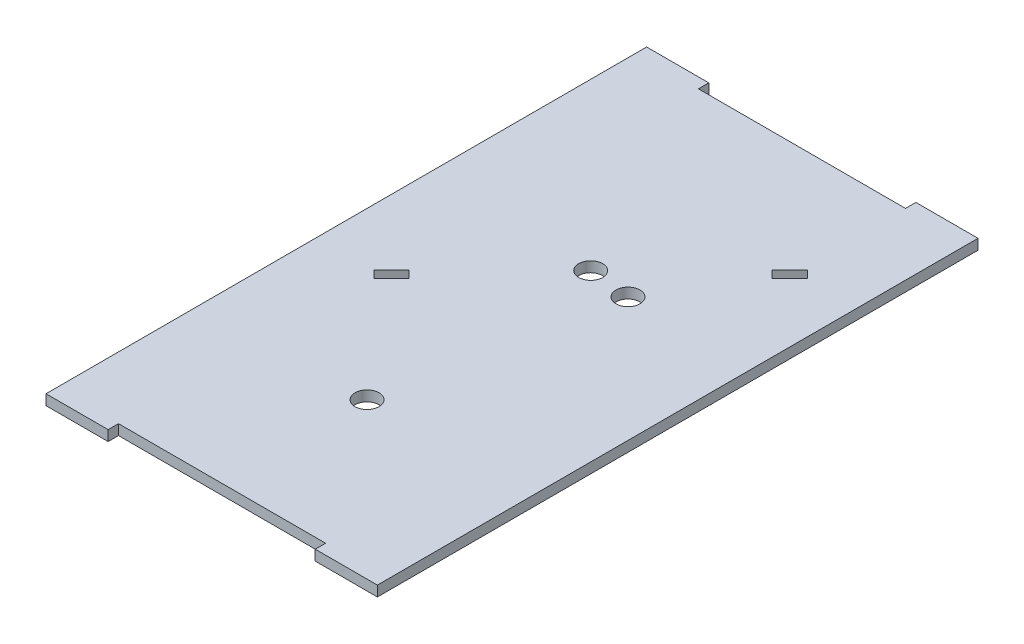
ISO-10303-21;
HEADER;
FILE_DESCRIPTION(('STEP AP214'),'2;1');
FILE_NAME('part.step','',(''),(''),'','','');
FILE_SCHEMA(('AUTOMOTIVE_DESIGN { 1 0 10303 214 1 1 1 1 }'));
ENDSEC;
DATA;
#1=APPLICATION_CONTEXT('core data for automotive mechanical design processes');
#2=APPLICATION_PROTOCOL_DEFINITION('international standard','automotive_design',2000,#1);
#3=PRODUCT_CONTEXT('',#1,'mechanical');
#4=PRODUCT('Part','Part','',(#3));
#5=PRODUCT_RELATED_PRODUCT_CATEGORY('part','',(#4));
#6=PRODUCT_DEFINITION_FORMATION('','',#4);
#7=PRODUCT_DEFINITION_CONTEXT('part definition',#1,'design');
#8=PRODUCT_DEFINITION('design','',#6,#7);
#9=PRODUCT_DEFINITION_SHAPE('','',#8);
#10=(LENGTH_UNIT() NAMED_UNIT(*) SI_UNIT(.MILLI.,.METRE.));
#11=(NAMED_UNIT(*) PLANE_ANGLE_UNIT() SI_UNIT($,.RADIAN.));
#12=(NAMED_UNIT(*) SI_UNIT($,.STERADIAN.) SOLID_ANGLE_UNIT());
#13=UNCERTAINTY_MEASURE_WITH_UNIT(LENGTH_MEASURE(1.E-05),#10,'distance_accuracy_value','');
#14=(GEOMETRIC_REPRESENTATION_CONTEXT(3) GLOBAL_UNCERTAINTY_ASSIGNED_CONTEXT((#13)) GLOBAL_UNIT_ASSIGNED_CONTEXT((#10,
#11,#12)) REPRESENTATION_CONTEXT('',''));
#15=CARTESIAN_POINT('',(0.,0.,0.));
#16=DIRECTION('',(0.,0.,1.));
#17=DIRECTION('',(1.,0.,0.));
#18=AXIS2_PLACEMENT_3D('',#15,#16,#17);
#19=CARTESIAN_POINT('',(0.,3.175,0.));
#20=DIRECTION('',(0.,0.,-1.));
#21=DIRECTION('',(-1.,0.,0.));
#22=AXIS2_PLACEMENT_3D('',#19,#20,#21);
#23=PLANE('',#22);
#24=DIRECTION('',(0.,-1.,0.));
#25=VECTOR('',#24,1.);
#26=CARTESIAN_POINT('',(19.05,3.175,0.));
#27=LINE('',#26,#25);
#28=CARTESIAN_POINT('',(19.05,3.175,0.));
#29=VERTEX_POINT('',#28);
#30=CARTESIAN_POINT('',(19.05,0.,0.));
#31=VERTEX_POINT('',#30);
#32=EDGE_CURVE('E236',#29,#31,#27,.T.);
#33=ORIENTED_EDGE('',*,*,#32,.T.);
#34=DIRECTION('',(1.,0.,0.));
#35=VECTOR('',#34,1.);
#36=CARTESIAN_POINT('',(0.,0.,0.));
#37=LINE('',#36,#35);
#38=CARTESIAN_POINT('',(82.55,0.,0.));
#39=VERTEX_POINT('',#38);
#40=EDGE_CURVE('E278',#31,#39,#37,.T.);
#41=ORIENTED_EDGE('',*,*,#40,.T.);
#42=DIRECTION('',(0.,-1.,0.));
#43=VECTOR('',#42,1.);
#44=CARTESIAN_POINT('',(82.55,3.175,0.));
#45=LINE('',#44,#43);
#46=CARTESIAN_POINT('',(82.55,3.175,0.));
#47=VERTEX_POINT('',#46);
#48=EDGE_CURVE('E263',#47,#39,#45,.T.);
#49=ORIENTED_EDGE('',*,*,#48,.F.);
#50=DIRECTION('',(1.,0.,0.));
#51=VECTOR('',#50,1.);
#52=CARTESIAN_POINT('',(0.,3.175,0.));
#53=LINE('',#52,#51);
#54=EDGE_CURVE('E283',#29,#47,#53,.T.);
#55=ORIENTED_EDGE('',*,*,#54,.F.);
#56=EDGE_LOOP('',(#33,#41,#49,#55));
#57=FACE_BOUND('',#56,.T.);
#58=ADVANCED_FACE('F33',(#57),#23,.F.);
#59=CARTESIAN_POINT('',(101.6,3.175,-177.8));
#60=DIRECTION('',(0.,0.,1.));
#61=DIRECTION('',(1.,0.,0.));
#62=AXIS2_PLACEMENT_3D('',#59,#60,#61);
#63=PLANE('',#62);
#64=DIRECTION('',(0.,-1.,0.));
#65=VECTOR('',#64,1.);
#66=CARTESIAN_POINT('',(82.55,3.175,-177.8));
#67=LINE('',#66,#65);
#68=CARTESIAN_POINT('',(82.55,3.175,-177.8));
#69=VERTEX_POINT('',#68);
#70=CARTESIAN_POINT('',(82.55,0.,-177.8));
#71=VERTEX_POINT('',#70);
#72=EDGE_CURVE('E332',#69,#71,#67,.T.);
#73=ORIENTED_EDGE('',*,*,#72,.T.);
#74=DIRECTION('',(-1.,0.,0.));
#75=VECTOR('',#74,1.);
#76=CARTESIAN_POINT('',(101.6,0.,-177.8));
#77=LINE('',#76,#75);
#78=CARTESIAN_POINT('',(19.05,0.,-177.8));
#79=VERTEX_POINT('',#78);
#80=EDGE_CURVE('E291',#71,#79,#77,.T.);
#81=ORIENTED_EDGE('',*,*,#80,.T.);
#82=DIRECTION('',(0.,-1.,0.));
#83=VECTOR('',#82,1.);
#84=CARTESIAN_POINT('',(19.05,3.175,-177.8));
#85=LINE('',#84,#83);
#86=CARTESIAN_POINT('',(19.05,3.175,-177.8));
#87=VERTEX_POINT('',#86);
#88=EDGE_CURVE('E294',#87,#79,#85,.T.);
#89=ORIENTED_EDGE('',*,*,#88,.F.);
#90=DIRECTION('',(-1.,0.,0.));
#91=VECTOR('',#90,1.);
#92=CARTESIAN_POINT('',(101.6,3.175,-177.8));
#93=LINE('',#92,#91);
#94=EDGE_CURVE('E303',#69,#87,#93,.T.);
#95=ORIENTED_EDGE('',*,*,#94,.F.);
#96=EDGE_LOOP('',(#73,#81,#89,#95));
#97=FACE_BOUND('',#96,.T.);
#98=ADVANCED_FACE('F353',(#97),#63,.F.);
#99=CARTESIAN_POINT('',(0.,3.175,0.));
#100=DIRECTION('',(1.,0.,0.));
#101=DIRECTION('',(0.,0.,-1.));
#102=AXIS2_PLACEMENT_3D('',#99,#100,#101);
#103=PLANE('',#102);
#104=DIRECTION('',(0.,0.,1.));
#105=VECTOR('',#104,1.);
#106=CARTESIAN_POINT('',(0.,0.,0.));
#107=LINE('',#106,#105);
#108=CARTESIAN_POINT('',(0.,0.,-180.975));
#109=VERTEX_POINT('',#108);
#110=CARTESIAN_POINT('',(0.,0.,3.17500000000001));
#111=VERTEX_POINT('',#110);
#112=EDGE_CURVE('E282',#109,#111,#107,.T.);
#113=ORIENTED_EDGE('',*,*,#112,.T.);
#114=DIRECTION('',(0.,-1.,0.));
#115=VECTOR('',#114,1.);
#116=CARTESIAN_POINT('',(0.,3.175,3.17500000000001));
#117=LINE('',#116,#115);
#118=CARTESIAN_POINT('',(0.,3.175,3.17500000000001));
#119=VERTEX_POINT('',#118);
#120=EDGE_CURVE('E246',#119,#111,#117,.T.);
#121=ORIENTED_EDGE('',*,*,#120,.F.);
#122=DIRECTION('',(0.,0.,1.));
#123=VECTOR('',#122,1.);
#124=CARTESIAN_POINT('',(0.,3.175,0.));
#125=LINE('',#124,#123);
#126=CARTESIAN_POINT('',(0.,3.175,-180.975));
#127=VERTEX_POINT('',#126);
#128=EDGE_CURVE('E300',#127,#119,#125,.T.);
#129=ORIENTED_EDGE('',*,*,#128,.F.);
#130=DIRECTION('',(0.,-1.,0.));
#131=VECTOR('',#130,1.);
#132=CARTESIAN_POINT('',(0.,3.175,-180.975));
#133=LINE('',#132,#131);
#134=EDGE_CURVE('E315',#127,#109,#133,.T.);
#135=ORIENTED_EDGE('',*,*,#134,.T.);
#136=EDGE_LOOP('',(#113,#121,#129,#135));
#137=FACE_BOUND('',#136,.T.);
#138=ADVANCED_FACE('F35',(#137),#103,.F.);
#139=CARTESIAN_POINT('',(101.6,3.175,0.));
#140=DIRECTION('',(-1.,0.,0.));
#141=DIRECTION('',(0.,0.,1.));
#142=AXIS2_PLACEMENT_3D('',#139,#140,#141);
#143=PLANE('',#142);
#144=DIRECTION('',(0.,0.,-1.));
#145=VECTOR('',#144,1.);
#146=CARTESIAN_POINT('',(101.6,0.,0.));
#147=LINE('',#146,#145);
#148=CARTESIAN_POINT('',(101.6,0.,3.17500000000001));
#149=VERTEX_POINT('',#148);
#150=CARTESIAN_POINT('',(101.6,0.,-180.975));
#151=VERTEX_POINT('',#150);
#152=EDGE_CURVE('E281',#149,#151,#147,.T.);
#153=ORIENTED_EDGE('',*,*,#152,.T.);
#154=DIRECTION('',(0.,-1.,0.));
#155=VECTOR('',#154,1.);
#156=CARTESIAN_POINT('',(101.6,3.175,-180.975));
#157=LINE('',#156,#155);
#158=CARTESIAN_POINT('',(101.6,3.175,-180.975));
#159=VERTEX_POINT('',#158);
#160=EDGE_CURVE('E326',#159,#151,#157,.T.);
#161=ORIENTED_EDGE('',*,*,#160,.F.);
#162=DIRECTION('',(0.,0.,-1.));
#163=VECTOR('',#162,1.);
#164=CARTESIAN_POINT('',(101.6,3.175,0.));
#165=LINE('',#164,#163);
#166=CARTESIAN_POINT('',(101.6,3.175,3.17500000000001));
#167=VERTEX_POINT('',#166);
#168=EDGE_CURVE('E305',#167,#159,#165,.T.);
#169=ORIENTED_EDGE('',*,*,#168,.F.);
#170=DIRECTION('',(0.,-1.,0.));
#171=VECTOR('',#170,1.);
#172=CARTESIAN_POINT('',(101.6,3.175,3.17500000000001));
#173=LINE('',#172,#171);
#174=EDGE_CURVE('E253',#167,#149,#173,.T.);
#175=ORIENTED_EDGE('',*,*,#174,.T.);
#176=EDGE_LOOP('',(#153,#161,#169,#175));
#177=FACE_BOUND('',#176,.T.);
#178=ADVANCED_FACE('F391',(#177),#143,.F.);
#179=CARTESIAN_POINT('',(0.,3.175,0.));
#180=DIRECTION('',(0.,1.,0.));
#181=DIRECTION('',(0.,0.,1.));
#182=AXIS2_PLACEMENT_3D('',#179,#180,#181);
#183=PLANE('',#182);
#184=DIRECTION('',(-0.707106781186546,0.,0.707106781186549));
#185=VECTOR('',#184,1.);
#186=CARTESIAN_POINT('',(83.8466014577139,3.175,-146.404268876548));
#187=LINE('',#186,#185);
#188=CARTESIAN_POINT('',(83.8466014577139,3.175,-146.404268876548));
#189=VERTEX_POINT('',#188);
#190=CARTESIAN_POINT('',(78.4584477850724,3.175,-141.016115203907));
#191=VERTEX_POINT('',#190);
#192=EDGE_CURVE('E48',#189,#191,#187,.T.);
#193=ORIENTED_EDGE('',*,*,#192,.F.);
#194=DIRECTION('',(-0.707106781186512,0.,-0.707106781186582));
#195=VECTOR('',#194,1.);
#196=CARTESIAN_POINT('',(83.8466014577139,3.175,-146.404268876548));
#197=LINE('',#196,#195);
#198=CARTESIAN_POINT('',(86.0916654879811,3.175,-144.159204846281));
#199=VERTEX_POINT('',#198);
#200=EDGE_CURVE('E189',#199,#189,#197,.T.);
#201=ORIENTED_EDGE('',*,*,#200,.F.);
#202=DIRECTION('',(0.707106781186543,0.,-0.707106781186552));
#203=VECTOR('',#202,1.);
#204=CARTESIAN_POINT('',(86.0916654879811,3.175,-144.159204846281));
#205=LINE('',#204,#203);
#206=CARTESIAN_POINT('',(80.7035118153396,3.175,-138.771051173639));
#207=VERTEX_POINT('',#206);
#208=EDGE_CURVE('E173',#207,#199,#205,.T.);
#209=ORIENTED_EDGE('',*,*,#208,.F.);
#210=DIRECTION('',(0.707106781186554,0.,0.707106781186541));
#211=VECTOR('',#210,1.);
#212=CARTESIAN_POINT('',(78.4584477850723,3.175,-141.016115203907));
#213=LINE('',#212,#211);
#214=EDGE_CURVE('E182',#191,#207,#213,.T.);
#215=ORIENTED_EDGE('',*,*,#214,.F.);
#216=EDGE_LOOP('',(#193,#201,#209,#215));
#217=FACE_BOUND('',#216,.T.);
#218=DIRECTION('',(0.707106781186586,0.,0.707106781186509));
#219=VECTOR('',#218,1.);
#220=CARTESIAN_POINT('',(17.4257311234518,3.175,-79.9833985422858));
#221=LINE('',#220,#219);
#222=CARTESIAN_POINT('',(17.4257311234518,3.175,-79.9833985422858));
#223=VERTEX_POINT('',#222);
#224=CARTESIAN_POINT('',(19.6707951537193,3.175,-77.7383345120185));
#225=VERTEX_POINT('',#224);
#226=EDGE_CURVE('E196',#223,#225,#221,.T.);
#227=ORIENTED_EDGE('',*,*,#226,.F.);
#228=DIRECTION('',(-0.707106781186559,0.,0.707106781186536));
#229=VECTOR('',#228,1.);
#230=CARTESIAN_POINT('',(17.4257311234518,3.175,-79.9833985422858));
#231=LINE('',#230,#229);
#232=CARTESIAN_POINT('',(22.8138847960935,3.175,-85.3715522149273));
#233=VERTEX_POINT('',#232);
#234=EDGE_CURVE('E206',#233,#223,#231,.T.);
#235=ORIENTED_EDGE('',*,*,#234,.F.);
#236=DIRECTION('',(-0.707106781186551,0.,-0.707106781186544));
#237=VECTOR('',#236,1.);
#238=CARTESIAN_POINT('',(22.8138847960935,3.175,-85.3715522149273));
#239=LINE('',#238,#237);
#240=CARTESIAN_POINT('',(25.0589488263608,3.175,-83.12648818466));
#241=VERTEX_POINT('',#240);
#242=EDGE_CURVE('E203',#241,#233,#239,.T.);
#243=ORIENTED_EDGE('',*,*,#242,.F.);
#244=DIRECTION('',(0.707106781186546,0.,-0.707106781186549));
#245=VECTOR('',#244,1.);
#246=CARTESIAN_POINT('',(19.6707951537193,3.175,-77.7383345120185));
#247=LINE('',#246,#245);
#248=EDGE_CURVE('E200',#225,#241,#247,.T.);
#249=ORIENTED_EDGE('',*,*,#248,.F.);
#250=EDGE_LOOP('',(#227,#235,#243,#249));
#251=FACE_BOUND('',#250,.T.);
#252=CARTESIAN_POINT('',(50.8,3.175,-113.03));
#253=DIRECTION('',(0.,1.,0.));
#254=DIRECTION('',(0.,0.,1.));
#255=AXIS2_PLACEMENT_3D('',#252,#253,#254);
#256=CIRCLE('',#255,3.683);
#257=CARTESIAN_POINT('',(50.8,3.175,-109.347));
#258=VERTEX_POINT('',#257);
#259=EDGE_CURVE('E212',#258,#258,#256,.T.);
#260=ORIENTED_EDGE('',*,*,#259,.F.);
#261=EDGE_LOOP('',(#260));
#262=FACE_BOUND('',#261,.T.);
#263=CARTESIAN_POINT('',(50.8,3.175,-44.45));
#264=DIRECTION('',(0.,1.,0.));
#265=DIRECTION('',(0.,0.,1.));
#266=AXIS2_PLACEMENT_3D('',#263,#264,#265);
#267=CIRCLE('',#266,3.683);
#268=CARTESIAN_POINT('',(50.8,3.175,-40.767));
#269=VERTEX_POINT('',#268);
#270=EDGE_CURVE('E222',#269,#269,#267,.T.);
#271=ORIENTED_EDGE('',*,*,#270,.F.);
#272=EDGE_LOOP('',(#271));
#273=FACE_BOUND('',#272,.T.);
#274=CARTESIAN_POINT('',(63.5,3.175,-111.76));
#275=DIRECTION('',(0.,1.,0.));
#276=DIRECTION('',(0.,0.,1.));
#277=AXIS2_PLACEMENT_3D('',#274,#275,#276);
#278=CIRCLE('',#277,3.68299999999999);
#279=CARTESIAN_POINT('',(63.5,3.175,-108.077));
#280=VERTEX_POINT('',#279);
#281=EDGE_CURVE('E226',#280,#280,#278,.T.);
#282=ORIENTED_EDGE('',*,*,#281,.F.);
#283=EDGE_LOOP('',(#282));
#284=FACE_BOUND('',#283,.T.);
#285=ORIENTED_EDGE('',*,*,#128,.T.);
#286=DIRECTION('',(1.,0.,0.));
#287=VECTOR('',#286,1.);
#288=CARTESIAN_POINT('',(0.,3.175,3.17500000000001));
#289=LINE('',#288,#287);
#290=CARTESIAN_POINT('',(19.05,3.175,3.17500000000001));
#291=VERTEX_POINT('',#290);
#292=EDGE_CURVE('E230',#119,#291,#289,.T.);
#293=ORIENTED_EDGE('',*,*,#292,.T.);
#294=DIRECTION('',(0.,0.,-1.));
#295=VECTOR('',#294,1.);
#296=CARTESIAN_POINT('',(19.05,3.175,0.));
#297=LINE('',#296,#295);
#298=EDGE_CURVE('E232',#291,#29,#297,.T.);
#299=ORIENTED_EDGE('',*,*,#298,.T.);
#300=ORIENTED_EDGE('',*,*,#54,.T.);
#301=DIRECTION('',(0.,0.,1.));
#302=VECTOR('',#301,1.);
#303=CARTESIAN_POINT('',(82.55,3.175,0.));
#304=LINE('',#303,#302);
#305=CARTESIAN_POINT('',(82.55,3.175,3.17500000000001));
#306=VERTEX_POINT('',#305);
#307=EDGE_CURVE('E254',#47,#306,#304,.T.);
#308=ORIENTED_EDGE('',*,*,#307,.T.);
#309=DIRECTION('',(1.,0.,0.));
#310=VECTOR('',#309,1.);
#311=CARTESIAN_POINT('',(101.6,3.175,3.17500000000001));
#312=LINE('',#311,#310);
#313=EDGE_CURVE('E250',#306,#167,#312,.T.);
#314=ORIENTED_EDGE('',*,*,#313,.T.);
#315=ORIENTED_EDGE('',*,*,#168,.T.);
#316=DIRECTION('',(-1.,0.,0.));
#317=VECTOR('',#316,1.);
#318=CARTESIAN_POINT('',(101.6,3.175,-180.975));
#319=LINE('',#318,#317);
#320=CARTESIAN_POINT('',(82.55,3.175,-180.975));
#321=VERTEX_POINT('',#320);
#322=EDGE_CURVE('E266',#159,#321,#319,.T.);
#323=ORIENTED_EDGE('',*,*,#322,.T.);
#324=DIRECTION('',(0.,0.,1.));
#325=VECTOR('',#324,1.);
#326=CARTESIAN_POINT('',(82.55,3.175,-177.8));
#327=LINE('',#326,#325);
#328=EDGE_CURVE('E335',#321,#69,#327,.T.);
#329=ORIENTED_EDGE('',*,*,#328,.T.);
#330=ORIENTED_EDGE('',*,*,#94,.T.);
#331=DIRECTION('',(0.,0.,-1.));
#332=VECTOR('',#331,1.);
#333=CARTESIAN_POINT('',(19.05,3.175,-177.8));
#334=LINE('',#333,#332);
#335=CARTESIAN_POINT('',(19.05,3.175,-180.975));
#336=VERTEX_POINT('',#335);
#337=EDGE_CURVE('E322',#87,#336,#334,.T.);
#338=ORIENTED_EDGE('',*,*,#337,.T.);
#339=DIRECTION('',(-1.,0.,0.));
#340=VECTOR('',#339,1.);
#341=CARTESIAN_POINT('',(0.,3.175,-180.975));
#342=LINE('',#341,#340);
#343=EDGE_CURVE('E318',#336,#127,#342,.T.);
#344=ORIENTED_EDGE('',*,*,#343,.T.);
#345=EDGE_LOOP('',(#285,#293,#299,#300,#308,#314,#315,#323,#329,#330,#338,#344));
#346=FACE_BOUND('',#345,.T.);
#347=ADVANCED_FACE('F186',(#217,#251,#262,#273,#284,#346),#183,.T.);
#348=CARTESIAN_POINT('',(0.,0.,0.));
#349=DIRECTION('',(0.,1.,0.));
#350=DIRECTION('',(0.,0.,1.));
#351=AXIS2_PLACEMENT_3D('',#348,#349,#350);
#352=PLANE('',#351);
#353=DIRECTION('',(-0.707106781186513,0.,-0.707106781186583));
#354=VECTOR('',#353,1.);
#355=CARTESIAN_POINT('',(115.125435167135,0.,-115.125435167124));
#356=LINE('',#355,#354);
#357=CARTESIAN_POINT('',(86.0916654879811,0.,-144.159204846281));
#358=VERTEX_POINT('',#357);
#359=CARTESIAN_POINT('',(83.8466014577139,0.,-146.404268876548));
#360=VERTEX_POINT('',#359);
#361=EDGE_CURVE('E41',#358,#360,#356,.T.);
#362=ORIENTED_EDGE('',*,*,#361,.T.);
#363=DIRECTION('',(-0.707106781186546,0.,0.707106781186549));
#364=VECTOR('',#363,1.);
#365=CARTESIAN_POINT('',(-31.278833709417,0.,-31.2788337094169));
#366=LINE('',#365,#364);
#367=CARTESIAN_POINT('',(78.4584477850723,0.,-141.016115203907));
#368=VERTEX_POINT('',#367);
#369=EDGE_CURVE('E11',#360,#368,#366,.T.);
#370=ORIENTED_EDGE('',*,*,#369,.T.);
#371=DIRECTION('',(0.707106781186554,0.,0.707106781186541));
#372=VECTOR('',#371,1.);
#373=CARTESIAN_POINT('',(109.737281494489,0.,-109.737281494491));
#374=LINE('',#373,#372);
#375=CARTESIAN_POINT('',(80.7035118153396,0.,-138.77105117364));
#376=VERTEX_POINT('',#375);
#377=EDGE_CURVE('E650',#368,#376,#374,.T.);
#378=ORIENTED_EDGE('',*,*,#377,.T.);
#379=DIRECTION('',(0.707106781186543,0.,-0.707106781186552));
#380=VECTOR('',#379,1.);
#381=CARTESIAN_POINT('',(-29.0337696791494,0.,-29.033769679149));
#382=LINE('',#381,#380);
#383=EDGE_CURVE('E176',#376,#358,#382,.T.);
#384=ORIENTED_EDGE('',*,*,#383,.T.);
#385=EDGE_LOOP('',(#362,#370,#378,#384));
#386=FACE_BOUND('',#385,.T.);
#387=DIRECTION('',(-0.707106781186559,0.,0.707106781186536));
#388=VECTOR('',#387,1.);
#389=CARTESIAN_POINT('',(-31.2788337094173,0.,-31.2788337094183));
#390=LINE('',#389,#388);
#391=CARTESIAN_POINT('',(22.8138847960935,0.,-85.3715522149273));
#392=VERTEX_POINT('',#391);
#393=CARTESIAN_POINT('',(17.4257311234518,0.,-79.9833985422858));
#394=VERTEX_POINT('',#393);
#395=EDGE_CURVE('E657',#392,#394,#390,.T.);
#396=ORIENTED_EDGE('',*,*,#395,.T.);
#397=DIRECTION('',(0.707106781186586,0.,0.707106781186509));
#398=VECTOR('',#397,1.);
#399=CARTESIAN_POINT('',(48.7045648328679,0.,-48.7045648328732));
#400=LINE('',#399,#398);
#401=CARTESIAN_POINT('',(19.6707951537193,0.,-77.7383345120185));
#402=VERTEX_POINT('',#401);
#403=EDGE_CURVE('E652',#394,#402,#400,.T.);
#404=ORIENTED_EDGE('',*,*,#403,.T.);
#405=DIRECTION('',(0.707106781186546,0.,-0.707106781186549));
#406=VECTOR('',#405,1.);
#407=CARTESIAN_POINT('',(-29.0337696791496,0.,-29.0337696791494));
#408=LINE('',#407,#406);
#409=CARTESIAN_POINT('',(25.0589488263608,0.,-83.12648818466));
#410=VERTEX_POINT('',#409);
#411=EDGE_CURVE('E304',#402,#410,#408,.T.);
#412=ORIENTED_EDGE('',*,*,#411,.T.);
#413=DIRECTION('',(-0.707106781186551,0.,-0.707106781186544));
#414=VECTOR('',#413,1.);
#415=CARTESIAN_POINT('',(54.0927185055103,0.,-54.0927185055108));
#416=LINE('',#415,#414);
#417=EDGE_CURVE('E660',#410,#392,#416,.T.);
#418=ORIENTED_EDGE('',*,*,#417,.T.);
#419=EDGE_LOOP('',(#396,#404,#412,#418));
#420=FACE_BOUND('',#419,.T.);
#421=CARTESIAN_POINT('',(50.8,0.,-113.03));
#422=DIRECTION('',(0.,1.,0.));
#423=DIRECTION('',(0.,0.,1.));
#424=AXIS2_PLACEMENT_3D('',#421,#422,#423);
#425=CIRCLE('',#424,3.683);
#426=CARTESIAN_POINT('',(50.8,0.,-109.347));
#427=VERTEX_POINT('',#426);
#428=EDGE_CURVE('E221',#427,#427,#425,.T.);
#429=ORIENTED_EDGE('',*,*,#428,.T.);
#430=EDGE_LOOP('',(#429));
#431=FACE_BOUND('',#430,.T.);
#432=CARTESIAN_POINT('',(50.8,0.,-44.45));
#433=DIRECTION('',(0.,1.,0.));
#434=DIRECTION('',(0.,0.,1.));
#435=AXIS2_PLACEMENT_3D('',#432,#433,#434);
#436=CIRCLE('',#435,3.683);
#437=CARTESIAN_POINT('',(50.8,0.,-40.767));
#438=VERTEX_POINT('',#437);
#439=EDGE_CURVE('E225',#438,#438,#436,.T.);
#440=ORIENTED_EDGE('',*,*,#439,.T.);
#441=EDGE_LOOP('',(#440));
#442=FACE_BOUND('',#441,.T.);
#443=CARTESIAN_POINT('',(63.5,0.,-111.76));
#444=DIRECTION('',(0.,1.,0.));
#445=DIRECTION('',(0.,0.,1.));
#446=AXIS2_PLACEMENT_3D('',#443,#444,#445);
#447=CIRCLE('',#446,3.68299999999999);
#448=CARTESIAN_POINT('',(63.5,0.,-108.077));
#449=VERTEX_POINT('',#448);
#450=EDGE_CURVE('E229',#449,#449,#447,.T.);
#451=ORIENTED_EDGE('',*,*,#450,.T.);
#452=EDGE_LOOP('',(#451));
#453=FACE_BOUND('',#452,.T.);
#454=ORIENTED_EDGE('',*,*,#112,.F.);
#455=DIRECTION('',(-1.,0.,0.));
#456=VECTOR('',#455,1.);
#457=CARTESIAN_POINT('',(0.,0.,-180.975));
#458=LINE('',#457,#456);
#459=CARTESIAN_POINT('',(19.05,0.,-180.975));
#460=VERTEX_POINT('',#459);
#461=EDGE_CURVE('E319',#460,#109,#458,.T.);
#462=ORIENTED_EDGE('',*,*,#461,.F.);
#463=DIRECTION('',(0.,0.,-1.));
#464=VECTOR('',#463,1.);
#465=CARTESIAN_POINT('',(19.05,0.,-177.8));
#466=LINE('',#465,#464);
#467=EDGE_CURVE('E323',#79,#460,#466,.T.);
#468=ORIENTED_EDGE('',*,*,#467,.F.);
#469=ORIENTED_EDGE('',*,*,#80,.F.);
#470=DIRECTION('',(0.,0.,1.));
#471=VECTOR('',#470,1.);
#472=CARTESIAN_POINT('',(82.55,0.,-177.8));
#473=LINE('',#472,#471);
#474=CARTESIAN_POINT('',(82.55,0.,-180.975));
#475=VERTEX_POINT('',#474);
#476=EDGE_CURVE('E336',#475,#71,#473,.T.);
#477=ORIENTED_EDGE('',*,*,#476,.F.);
#478=DIRECTION('',(-1.,0.,0.));
#479=VECTOR('',#478,1.);
#480=CARTESIAN_POINT('',(101.6,0.,-180.975));
#481=LINE('',#480,#479);
#482=EDGE_CURVE('E272',#151,#475,#481,.T.);
#483=ORIENTED_EDGE('',*,*,#482,.F.);
#484=ORIENTED_EDGE('',*,*,#152,.F.);
#485=DIRECTION('',(1.,0.,0.));
#486=VECTOR('',#485,1.);
#487=CARTESIAN_POINT('',(101.6,0.,3.17500000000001));
#488=LINE('',#487,#486);
#489=CARTESIAN_POINT('',(82.55,0.,3.17500000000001));
#490=VERTEX_POINT('',#489);
#491=EDGE_CURVE('E255',#490,#149,#488,.T.);
#492=ORIENTED_EDGE('',*,*,#491,.F.);
#493=DIRECTION('',(0.,0.,1.));
#494=VECTOR('',#493,1.);
#495=CARTESIAN_POINT('',(82.55,0.,0.));
#496=LINE('',#495,#494);
#497=EDGE_CURVE('E249',#39,#490,#496,.T.);
#498=ORIENTED_EDGE('',*,*,#497,.F.);
#499=ORIENTED_EDGE('',*,*,#40,.F.);
#500=DIRECTION('',(0.,0.,-1.));
#501=VECTOR('',#500,1.);
#502=CARTESIAN_POINT('',(19.05,0.,0.));
#503=LINE('',#502,#501);
#504=CARTESIAN_POINT('',(19.05,0.,3.17500000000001));
#505=VERTEX_POINT('',#504);
#506=EDGE_CURVE('E233',#505,#31,#503,.T.);
#507=ORIENTED_EDGE('',*,*,#506,.F.);
#508=DIRECTION('',(1.,0.,0.));
#509=VECTOR('',#508,1.);
#510=CARTESIAN_POINT('',(0.,0.,3.17500000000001));
#511=LINE('',#510,#509);
#512=EDGE_CURVE('E237',#111,#505,#511,.T.);
#513=ORIENTED_EDGE('',*,*,#512,.F.);
#514=EDGE_LOOP('',(#454,#462,#468,#469,#477,#483,#484,#492,#498,#499,#507,#513));
#515=FACE_BOUND('',#514,.T.);
#516=ADVANCED_FACE('F393',(#386,#420,#431,#442,#453,#515),#352,.F.);
#517=CARTESIAN_POINT('',(19.05,3.175,-177.8));
#518=DIRECTION('',(-1.,0.,0.));
#519=DIRECTION('',(0.,0.,1.));
#520=AXIS2_PLACEMENT_3D('',#517,#518,#519);
#521=PLANE('',#520);
#522=ORIENTED_EDGE('',*,*,#467,.T.);
#523=DIRECTION('',(0.,-1.,0.));
#524=VECTOR('',#523,1.);
#525=CARTESIAN_POINT('',(19.05,3.175,-180.975));
#526=LINE('',#525,#524);
#527=EDGE_CURVE('E312',#336,#460,#526,.T.);
#528=ORIENTED_EDGE('',*,*,#527,.F.);
#529=ORIENTED_EDGE('',*,*,#337,.F.);
#530=ORIENTED_EDGE('',*,*,#88,.T.);
#531=EDGE_LOOP('',(#522,#528,#529,#530));
#532=FACE_BOUND('',#531,.T.);
#533=ADVANCED_FACE('F361',(#532),#521,.F.);
#534=CARTESIAN_POINT('',(0.,3.175,-180.975));
#535=DIRECTION('',(0.,0.,1.));
#536=DIRECTION('',(1.,0.,0.));
#537=AXIS2_PLACEMENT_3D('',#534,#535,#536);
#538=PLANE('',#537);
#539=ORIENTED_EDGE('',*,*,#461,.T.);
#540=ORIENTED_EDGE('',*,*,#134,.F.);
#541=ORIENTED_EDGE('',*,*,#343,.F.);
#542=ORIENTED_EDGE('',*,*,#527,.T.);
#543=EDGE_LOOP('',(#539,#540,#541,#542));
#544=FACE_BOUND('',#543,.T.);
#545=ADVANCED_FACE('F365',(#544),#538,.F.);
#546=CARTESIAN_POINT('',(101.6,3.175,-180.975));
#547=DIRECTION('',(0.,0.,1.));
#548=DIRECTION('',(1.,0.,0.));
#549=AXIS2_PLACEMENT_3D('',#546,#547,#548);
#550=PLANE('',#549);
#551=ORIENTED_EDGE('',*,*,#482,.T.);
#552=DIRECTION('',(0.,-1.,0.));
#553=VECTOR('',#552,1.);
#554=CARTESIAN_POINT('',(82.55,3.175,-180.975));
#555=LINE('',#554,#553);
#556=EDGE_CURVE('E329',#321,#475,#555,.T.);
#557=ORIENTED_EDGE('',*,*,#556,.F.);
#558=ORIENTED_EDGE('',*,*,#322,.F.);
#559=ORIENTED_EDGE('',*,*,#160,.T.);
#560=EDGE_LOOP('',(#551,#557,#558,#559));
#561=FACE_BOUND('',#560,.T.);
#562=ADVANCED_FACE('F347',(#561),#550,.F.);
#563=CARTESIAN_POINT('',(82.55,3.175,-177.8));
#564=DIRECTION('',(1.,0.,0.));
#565=DIRECTION('',(0.,0.,-1.));
#566=AXIS2_PLACEMENT_3D('',#563,#564,#565);
#567=PLANE('',#566);
#568=ORIENTED_EDGE('',*,*,#476,.T.);
#569=ORIENTED_EDGE('',*,*,#72,.F.);
#570=ORIENTED_EDGE('',*,*,#328,.F.);
#571=ORIENTED_EDGE('',*,*,#556,.T.);
#572=EDGE_LOOP('',(#568,#569,#570,#571));
#573=FACE_BOUND('',#572,.T.);
#574=ADVANCED_FACE('F351',(#573),#567,.F.);
#575=CARTESIAN_POINT('',(82.55,3.175,0.));
#576=DIRECTION('',(1.,0.,0.));
#577=DIRECTION('',(0.,0.,-1.));
#578=AXIS2_PLACEMENT_3D('',#575,#576,#577);
#579=PLANE('',#578);
#580=ORIENTED_EDGE('',*,*,#497,.T.);
#581=DIRECTION('',(0.,-1.,0.));
#582=VECTOR('',#581,1.);
#583=CARTESIAN_POINT('',(82.55,3.175,3.17500000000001));
#584=LINE('',#583,#582);
#585=EDGE_CURVE('E260',#306,#490,#584,.T.);
#586=ORIENTED_EDGE('',*,*,#585,.F.);
#587=ORIENTED_EDGE('',*,*,#307,.F.);
#588=ORIENTED_EDGE('',*,*,#48,.T.);
#589=EDGE_LOOP('',(#580,#586,#587,#588));
#590=FACE_BOUND('',#589,.T.);
#591=ADVANCED_FACE('F386',(#590),#579,.F.);
#592=CARTESIAN_POINT('',(101.6,3.175,3.17500000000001));
#593=DIRECTION('',(0.,0.,-1.));
#594=DIRECTION('',(-1.,0.,0.));
#595=AXIS2_PLACEMENT_3D('',#592,#593,#594);
#596=PLANE('',#595);
#597=ORIENTED_EDGE('',*,*,#491,.T.);
#598=ORIENTED_EDGE('',*,*,#174,.F.);
#599=ORIENTED_EDGE('',*,*,#313,.F.);
#600=ORIENTED_EDGE('',*,*,#585,.T.);
#601=EDGE_LOOP('',(#597,#598,#599,#600));
#602=FACE_BOUND('',#601,.T.);
#603=ADVANCED_FACE('F389',(#602),#596,.F.);
#604=CARTESIAN_POINT('',(0.,3.175,3.17500000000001));
#605=DIRECTION('',(0.,0.,-1.));
#606=DIRECTION('',(-1.,0.,0.));
#607=AXIS2_PLACEMENT_3D('',#604,#605,#606);
#608=PLANE('',#607);
#609=ORIENTED_EDGE('',*,*,#512,.T.);
#610=DIRECTION('',(0.,-1.,0.));
#611=VECTOR('',#610,1.);
#612=CARTESIAN_POINT('',(19.05,3.175,3.17500000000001));
#613=LINE('',#612,#611);
#614=EDGE_CURVE('E243',#291,#505,#613,.T.);
#615=ORIENTED_EDGE('',*,*,#614,.F.);
#616=ORIENTED_EDGE('',*,*,#292,.F.);
#617=ORIENTED_EDGE('',*,*,#120,.T.);
#618=EDGE_LOOP('',(#609,#615,#616,#617));
#619=FACE_BOUND('',#618,.T.);
#620=ADVANCED_FACE('F373',(#619),#608,.F.);
#621=CARTESIAN_POINT('',(19.05,3.175,0.));
#622=DIRECTION('',(-1.,0.,0.));
#623=DIRECTION('',(0.,0.,1.));
#624=AXIS2_PLACEMENT_3D('',#621,#622,#623);
#625=PLANE('',#624);
#626=ORIENTED_EDGE('',*,*,#506,.T.);
#627=ORIENTED_EDGE('',*,*,#32,.F.);
#628=ORIENTED_EDGE('',*,*,#298,.F.);
#629=ORIENTED_EDGE('',*,*,#614,.T.);
#630=EDGE_LOOP('',(#626,#627,#628,#629));
#631=FACE_BOUND('',#630,.T.);
#632=ADVANCED_FACE('F377',(#631),#625,.F.);
#633=CARTESIAN_POINT('',(63.5,-5.00000000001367E-05,-111.76));
#634=DIRECTION('',(0.,1.,0.));
#635=DIRECTION('',(0.,0.,1.));
#636=AXIS2_PLACEMENT_3D('',#633,#634,#635);
#637=CYLINDRICAL_SURFACE('',#636,3.68299999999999);
#638=ORIENTED_EDGE('',*,*,#281,.T.);
#639=EDGE_LOOP('',(#638));
#640=FACE_BOUND('',#639,.T.);
#641=ORIENTED_EDGE('',*,*,#450,.F.);
#642=EDGE_LOOP('',(#641));
#643=FACE_BOUND('',#642,.T.);
#644=ADVANCED_FACE('F537',(#640,#643),#637,.F.);
#645=CARTESIAN_POINT('',(50.8,-5.00000000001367E-05,-44.45));
#646=DIRECTION('',(0.,1.,0.));
#647=DIRECTION('',(0.,0.,1.));
#648=AXIS2_PLACEMENT_3D('',#645,#646,#647);
#649=CYLINDRICAL_SURFACE('',#648,3.683);
#650=ORIENTED_EDGE('',*,*,#270,.T.);
#651=EDGE_LOOP('',(#650));
#652=FACE_BOUND('',#651,.T.);
#653=ORIENTED_EDGE('',*,*,#439,.F.);
#654=EDGE_LOOP('',(#653));
#655=FACE_BOUND('',#654,.T.);
#656=ADVANCED_FACE('F545',(#652,#655),#649,.F.);
#657=CARTESIAN_POINT('',(50.8,-5.00000000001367E-05,-113.03));
#658=DIRECTION('',(0.,1.,0.));
#659=DIRECTION('',(0.,0.,1.));
#660=AXIS2_PLACEMENT_3D('',#657,#658,#659);
#661=CYLINDRICAL_SURFACE('',#660,3.683);
#662=ORIENTED_EDGE('',*,*,#259,.T.);
#663=EDGE_LOOP('',(#662));
#664=FACE_BOUND('',#663,.T.);
#665=ORIENTED_EDGE('',*,*,#428,.F.);
#666=EDGE_LOOP('',(#665));
#667=FACE_BOUND('',#666,.T.);
#668=ADVANCED_FACE('F554',(#664,#667),#661,.F.);
#669=CARTESIAN_POINT('',(17.4257311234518,-5.00000000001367E-05,-79.9833985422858));
#670=DIRECTION('',(-0.707106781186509,0.,0.707106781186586));
#671=DIRECTION('',(0.707106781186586,0.,0.707106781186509));
#672=AXIS2_PLACEMENT_3D('',#669,#670,#671);
#673=PLANE('',#672);
#674=DIRECTION('',(0.,1.,0.));
#675=VECTOR('',#674,1.);
#676=CARTESIAN_POINT('',(17.4257311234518,-5.00000000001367E-05,-79.9833985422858));
#677=LINE('',#676,#675);
#678=EDGE_CURVE('E210',#394,#223,#677,.T.);
#679=ORIENTED_EDGE('',*,*,#678,.T.);
#680=ORIENTED_EDGE('',*,*,#226,.T.);
#681=DIRECTION('',(0.,1.,0.));
#682=VECTOR('',#681,1.);
#683=CARTESIAN_POINT('',(19.6707951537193,-5.00000000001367E-05,-77.7383345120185));
#684=LINE('',#683,#682);
#685=EDGE_CURVE('E209',#402,#225,#684,.T.);
#686=ORIENTED_EDGE('',*,*,#685,.F.);
#687=ORIENTED_EDGE('',*,*,#403,.F.);
#688=EDGE_LOOP('',(#679,#680,#686,#687));
#689=FACE_BOUND('',#688,.T.);
#690=ADVANCED_FACE('F562',(#689),#673,.F.);
#691=CARTESIAN_POINT('',(17.4257311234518,-5.00000000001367E-05,-79.9833985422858));
#692=DIRECTION('',(-0.707106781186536,0.,-0.707106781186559));
#693=DIRECTION('',(-0.707106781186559,0.,0.707106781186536));
#694=AXIS2_PLACEMENT_3D('',#691,#692,#693);
#695=PLANE('',#694);
#696=DIRECTION('',(0.,1.,0.));
#697=VECTOR('',#696,1.);
#698=CARTESIAN_POINT('',(22.8138847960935,-5.00000000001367E-05,-85.3715522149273));
#699=LINE('',#698,#697);
#700=EDGE_CURVE('E213',#392,#233,#699,.T.);
#701=ORIENTED_EDGE('',*,*,#700,.T.);
#702=ORIENTED_EDGE('',*,*,#234,.T.);
#703=ORIENTED_EDGE('',*,*,#678,.F.);
#704=ORIENTED_EDGE('',*,*,#395,.F.);
#705=EDGE_LOOP('',(#701,#702,#703,#704));
#706=FACE_BOUND('',#705,.T.);
#707=ADVANCED_FACE('F570',(#706),#695,.F.);
#708=CARTESIAN_POINT('',(22.8138847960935,-5.00000000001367E-05,-85.3715522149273));
#709=DIRECTION('',(0.707106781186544,0.,-0.707106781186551));
#710=DIRECTION('',(-0.707106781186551,0.,-0.707106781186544));
#711=AXIS2_PLACEMENT_3D('',#708,#709,#710);
#712=PLANE('',#711);
#713=DIRECTION('',(0.,1.,0.));
#714=VECTOR('',#713,1.);
#715=CARTESIAN_POINT('',(25.0589488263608,-5.00000000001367E-05,-83.12648818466));
#716=LINE('',#715,#714);
#717=EDGE_CURVE('E215',#410,#241,#716,.T.);
#718=ORIENTED_EDGE('',*,*,#717,.T.);
#719=ORIENTED_EDGE('',*,*,#242,.T.);
#720=ORIENTED_EDGE('',*,*,#700,.F.);
#721=ORIENTED_EDGE('',*,*,#417,.F.);
#722=EDGE_LOOP('',(#718,#719,#720,#721));
#723=FACE_BOUND('',#722,.T.);
#724=ADVANCED_FACE('F579',(#723),#712,.F.);
#725=CARTESIAN_POINT('',(19.6707951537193,-5.00000000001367E-05,-77.7383345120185));
#726=DIRECTION('',(0.707106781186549,0.,0.707106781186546));
#727=DIRECTION('',(0.707106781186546,0.,-0.707106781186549));
#728=AXIS2_PLACEMENT_3D('',#725,#726,#727);
#729=PLANE('',#728);
#730=ORIENTED_EDGE('',*,*,#685,.T.);
#731=ORIENTED_EDGE('',*,*,#248,.T.);
#732=ORIENTED_EDGE('',*,*,#717,.F.);
#733=ORIENTED_EDGE('',*,*,#411,.F.);
#734=EDGE_LOOP('',(#730,#731,#732,#733));
#735=FACE_BOUND('',#734,.T.);
#736=ADVANCED_FACE('F588',(#735),#729,.F.);
#737=CARTESIAN_POINT('',(83.8466014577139,-5.00000000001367E-05,-146.404268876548));
#738=DIRECTION('',(-0.707106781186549,0.,-0.707106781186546));
#739=DIRECTION('',(-0.707106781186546,0.,0.707106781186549));
#740=AXIS2_PLACEMENT_3D('',#737,#738,#739);
#741=PLANE('',#740);
#742=DIRECTION('',(0.,1.,0.));
#743=VECTOR('',#742,1.);
#744=CARTESIAN_POINT('',(83.8466014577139,-5.00000000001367E-05,-146.404268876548));
#745=LINE('',#744,#743);
#746=EDGE_CURVE('E194',#360,#189,#745,.T.);
#747=ORIENTED_EDGE('',*,*,#746,.T.);
#748=ORIENTED_EDGE('',*,*,#192,.T.);
#749=DIRECTION('',(0.,1.,0.));
#750=VECTOR('',#749,1.);
#751=CARTESIAN_POINT('',(78.4584477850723,-5.00000000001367E-05,-141.016115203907));
#752=LINE('',#751,#750);
#753=EDGE_CURVE('E179',#368,#191,#752,.T.);
#754=ORIENTED_EDGE('',*,*,#753,.F.);
#755=ORIENTED_EDGE('',*,*,#369,.F.);
#756=EDGE_LOOP('',(#747,#748,#754,#755));
#757=FACE_BOUND('',#756,.T.);
#758=ADVANCED_FACE('F597',(#757),#741,.F.);
#759=CARTESIAN_POINT('',(83.8466014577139,-5.00000000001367E-05,-146.404268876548));
#760=DIRECTION('',(0.707106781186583,0.,-0.707106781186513));
#761=DIRECTION('',(-0.707106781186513,0.,-0.707106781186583));
#762=AXIS2_PLACEMENT_3D('',#759,#760,#761);
#763=PLANE('',#762);
#764=DIRECTION('',(0.,1.,0.));
#765=VECTOR('',#764,1.);
#766=CARTESIAN_POINT('',(86.0916654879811,-5.00000000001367E-05,-144.159204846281));
#767=LINE('',#766,#765);
#768=EDGE_CURVE('E178',#358,#199,#767,.T.);
#769=ORIENTED_EDGE('',*,*,#768,.T.);
#770=ORIENTED_EDGE('',*,*,#200,.T.);
#771=ORIENTED_EDGE('',*,*,#746,.F.);
#772=ORIENTED_EDGE('',*,*,#361,.F.);
#773=EDGE_LOOP('',(#769,#770,#771,#772));
#774=FACE_BOUND('',#773,.T.);
#775=ADVANCED_FACE('F606',(#774),#763,.F.);
#776=CARTESIAN_POINT('',(86.0916654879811,-5.00000000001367E-05,-144.159204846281));
#777=DIRECTION('',(0.707106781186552,0.,0.707106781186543));
#778=DIRECTION('',(0.707106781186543,0.,-0.707106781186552));
#779=AXIS2_PLACEMENT_3D('',#776,#777,#778);
#780=PLANE('',#779);
#781=DIRECTION('',(0.,1.,0.));
#782=VECTOR('',#781,1.);
#783=CARTESIAN_POINT('',(80.7035118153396,-5.00000000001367E-05,-138.771051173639));
#784=LINE('',#783,#782);
#785=EDGE_CURVE('E56',#376,#207,#784,.T.);
#786=ORIENTED_EDGE('',*,*,#785,.T.);
#787=ORIENTED_EDGE('',*,*,#208,.T.);
#788=ORIENTED_EDGE('',*,*,#768,.F.);
#789=ORIENTED_EDGE('',*,*,#383,.F.);
#790=EDGE_LOOP('',(#786,#787,#788,#789));
#791=FACE_BOUND('',#790,.T.);
#792=ADVANCED_FACE('F170',(#791),#780,.F.);
#793=CARTESIAN_POINT('',(78.4584477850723,-5.00000000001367E-05,-141.016115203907));
#794=DIRECTION('',(-0.707106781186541,0.,0.707106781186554));
#795=DIRECTION('',(0.707106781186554,0.,0.707106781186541));
#796=AXIS2_PLACEMENT_3D('',#793,#794,#795);
#797=PLANE('',#796);
#798=ORIENTED_EDGE('',*,*,#753,.T.);
#799=ORIENTED_EDGE('',*,*,#214,.T.);
#800=ORIENTED_EDGE('',*,*,#785,.F.);
#801=ORIENTED_EDGE('',*,*,#377,.F.);
#802=EDGE_LOOP('',(#798,#799,#800,#801));
#803=FACE_BOUND('',#802,.T.);
#804=ADVANCED_FACE('F183',(#803),#797,.F.);
#805=CLOSED_SHELL('',(#58,#98,#138,#178,#347,#516,#533,#545,#562,#574,#591,#603,#620,#632,#644,
#656,#668,#690,#707,#724,#736,#758,#775,#792,#804));
#806=MANIFOLD_SOLID_BREP('B2',#805);
#807=ADVANCED_BREP_SHAPE_REPRESENTATION('',(#18,#806),#14);
#808=SHAPE_DEFINITION_REPRESENTATION(#9,#807);
ENDSEC;
END-ISO-10303-21;
